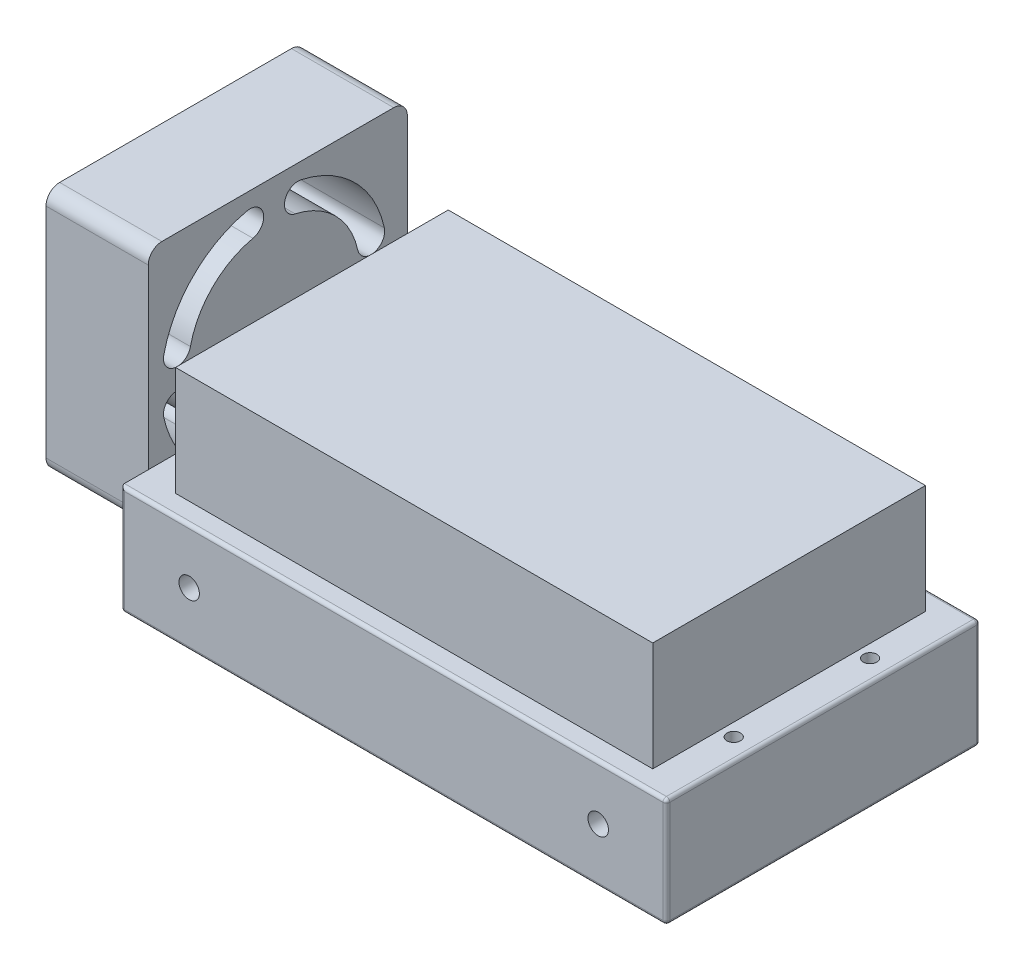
from build123d import *

# Parameters (mm, degrees)
SKETCH1_W           = 80
SKETCH1_H           = 46
BOSS_EXTRUDE1_DEPTH = 16
SKETCH2_W           = 38
SKETCH2_H           = 36
BOSS_EXTRUDE2_DEPTH = 15
CUT_EXTRUDE1_DEPTH  = 15
CIRPATTERN1_COUNT   = 4
FILLET1_R           = 2
FILLET2_R           = 0.5
SKETCH4_W           = 70
SKETCH4_H           = 40
BOSS_EXTRUDE3_DEPTH = 16
SKETCH5_R           = 1.5
CUT_EXTRUDE2_DEPTH  = 6
SKETCH6_R           = 1
CUT_EXTRUDE3_DEPTH  = 66.8634952


with BuildPart() as part:
    # Sketch1 → Boss-Extrude1 (new body)
    with BuildSketch(Plane(origin=(0, 0, 0), x_dir=(1, 0, 0), z_dir=(0, 1, 0))):
        Rectangle(SKETCH1_W, SKETCH1_H)
    extrude(amount=BOSS_EXTRUDE1_DEPTH)

    # Sketch2 → Boss-Extrude2 (add)
    with BuildSketch(Plane.ZY.offset(40)):
        with Locations((0, 26)):
            Rectangle(SKETCH2_W, SKETCH2_H)
    extrude(amount=BOSS_EXTRUDE2_DEPTH)

    # Sketch3 → Cut-Extrude1 (cut)
    with BuildSketch(Plane.ZY.offset(55)):
        with BuildLine():
            ThreePointArc((-3.408835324, 41.632653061), (-11.313708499, 37.313708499), (-15.632653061, 29.408835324))
            ThreePointArc((-15.632653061, 29.408835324), (-14.104675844, 27.028649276), (-11.724489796, 28.556626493))
            ThreePointArc((-11.724489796, 28.556626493), (-8.485281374, 34.485281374), (-2.556626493, 37.724489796))
            ThreePointArc((-2.556626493, 37.724489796), (-1.028649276, 40.104675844), (-3.408835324, 41.632653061))
        make_face()
    cut_extrude1 = extrude(amount=-CUT_EXTRUDE1_DEPTH, mode=Mode.SUBTRACT)

    # CirPattern1: Cut-Extrude1 ×4 about axis
    cirpattern1_axis = Axis((0, 25.455172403, 0.544827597), (1, 0, 0))
    for i in range(1, CIRPATTERN1_COUNT):
        add(cut_extrude1.rotate(cirpattern1_axis, i * 360 / CIRPATTERN1_COUNT), mode=Mode.SUBTRACT)

    # Fillet1
    fillet1_edges = [part.edges().sort_by_distance(p)[0] for p in [
        (-47.5, 44, -19),
        (-47.5, 8, -19),
        (-47.5, 8, 19),
        (-47.5, 44, 19),
    ]]
    fillet(fillet1_edges, radius=FILLET1_R)

    # Fillet2
    fillet2_edges = [part.edges().sort_by_distance(p)[0] for p in [
        (0, 16, 23),
        (40, 16, 0),
        (0, 0, 23),
        (-40, 0, 0),
        (0, 0, -23),
        (40, 0, 0),
        (40, 8, 23),
        (-40, 8, 23),
        (-40, 8, -23),
        (40, 8, -23),
        (0, 16, -23),
    ]]
    fillet(fillet2_edges, radius=FILLET2_R)

    # Sketch4 → Boss-Extrude3 (add)
    with BuildSketch(Plane(origin=(0, 16, 0), x_dir=(1, 0, 0), z_dir=(0, 1, 0))):
        Rectangle(SKETCH4_W, SKETCH4_H)
    extrude(amount=BOSS_EXTRUDE3_DEPTH)

    # Sketch5 → Cut-Extrude2 (cut)
    with BuildSketch(Plane.XY.offset(23)):
        with Locations((-30, 8)):
            Circle(SKETCH5_R)
        with Locations((30, 8)):
            Circle(SKETCH5_R)
    extrude(amount=-CUT_EXTRUDE2_DEPTH, mode=Mode.SUBTRACT)

    # Sketch6 → Cut-Extrude3 (cut, through all)
    with BuildSketch(Plane(origin=(0, 16, 0), x_dir=(1, 0, 0), z_dir=(0, 1, 0))):
        with Locations(Location((36.873699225, 10, 0), (0, 0, 270))):
            Circle(SKETCH6_R)
        with Locations(Location((36.873699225, -10, 0), (0, 0, 270))):
            Circle(SKETCH6_R)
    extrude(amount=-CUT_EXTRUDE3_DEPTH, mode=Mode.SUBTRACT)


solid = part.part
